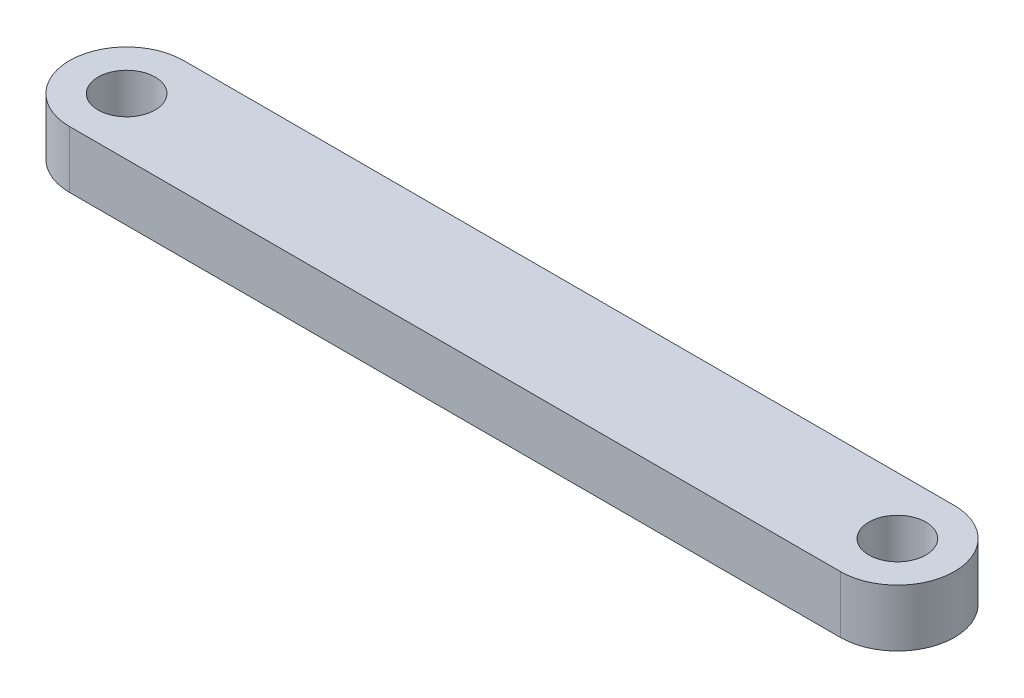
ISO-10303-21;
HEADER;
FILE_DESCRIPTION(('STEP AP214'),'2;1');
FILE_NAME('part.step','',(''),(''),'','','');
FILE_SCHEMA(('AUTOMOTIVE_DESIGN { 1 0 10303 214 1 1 1 1 }'));
ENDSEC;
DATA;
#1=APPLICATION_CONTEXT('core data for automotive mechanical design processes');
#2=APPLICATION_PROTOCOL_DEFINITION('international standard','automotive_design',2000,#1);
#3=PRODUCT_CONTEXT('',#1,'mechanical');
#4=PRODUCT('Part','Part','',(#3));
#5=PRODUCT_RELATED_PRODUCT_CATEGORY('part','',(#4));
#6=PRODUCT_DEFINITION_FORMATION('','',#4);
#7=PRODUCT_DEFINITION_CONTEXT('part definition',#1,'design');
#8=PRODUCT_DEFINITION('design','',#6,#7);
#9=PRODUCT_DEFINITION_SHAPE('','',#8);
#10=(LENGTH_UNIT() NAMED_UNIT(*) SI_UNIT(.MILLI.,.METRE.));
#11=(NAMED_UNIT(*) PLANE_ANGLE_UNIT() SI_UNIT($,.RADIAN.));
#12=(NAMED_UNIT(*) SI_UNIT($,.STERADIAN.) SOLID_ANGLE_UNIT());
#13=UNCERTAINTY_MEASURE_WITH_UNIT(LENGTH_MEASURE(1.E-05),#10,'distance_accuracy_value','');
#14=(GEOMETRIC_REPRESENTATION_CONTEXT(3) GLOBAL_UNCERTAINTY_ASSIGNED_CONTEXT((#13)) GLOBAL_UNIT_ASSIGNED_CONTEXT((#10,
#11,#12)) REPRESENTATION_CONTEXT('',''));
#15=CARTESIAN_POINT('',(0.,0.,0.));
#16=DIRECTION('',(0.,0.,1.));
#17=DIRECTION('',(1.,0.,0.));
#18=AXIS2_PLACEMENT_3D('',#15,#16,#17);
#19=CARTESIAN_POINT('',(-675.,50.,0.));
#20=DIRECTION('',(0.,1.,0.));
#21=DIRECTION('',(0.,0.,1.));
#22=AXIS2_PLACEMENT_3D('',#19,#20,#21);
#23=PLANE('',#22);
#24=CARTESIAN_POINT('',(-675.,50.,0.));
#25=DIRECTION('',(0.,1.,0.));
#26=DIRECTION('',(0.,0.,1.));
#27=AXIS2_PLACEMENT_3D('',#24,#25,#26);
#28=CIRCLE('',#27,50.);
#29=CARTESIAN_POINT('',(-675.,50.,50.));
#30=VERTEX_POINT('',#29);
#31=EDGE_CURVE('E112',#30,#30,#28,.T.);
#32=ORIENTED_EDGE('',*,*,#31,.F.);
#33=EDGE_LOOP('',(#32));
#34=FACE_BOUND('',#33,.T.);
#35=CARTESIAN_POINT('',(-675.,50.,0.));
#36=DIRECTION('',(0.,1.,0.));
#37=DIRECTION('',(0.,0.,1.));
#38=AXIS2_PLACEMENT_3D('',#35,#36,#37);
#39=CIRCLE('',#38,100.);
#40=CARTESIAN_POINT('',(-675.,50.,-100.));
#41=VERTEX_POINT('',#40);
#42=CARTESIAN_POINT('',(-675.,50.,100.));
#43=VERTEX_POINT('',#42);
#44=EDGE_CURVE('E91',#41,#43,#39,.T.);
#45=ORIENTED_EDGE('',*,*,#44,.T.);
#46=DIRECTION('',(1.,0.,0.));
#47=VECTOR('',#46,1.);
#48=CARTESIAN_POINT('',(-675.,50.,100.));
#49=LINE('',#48,#47);
#50=CARTESIAN_POINT('',(675.,50.,99.9999999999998));
#51=VERTEX_POINT('',#50);
#52=EDGE_CURVE('E86',#43,#51,#49,.T.);
#53=ORIENTED_EDGE('',*,*,#52,.T.);
#54=CARTESIAN_POINT('',(675.,50.,-2.47990976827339E-13));
#55=DIRECTION('',(0.,1.,0.));
#56=DIRECTION('',(0.,0.,1.));
#57=AXIS2_PLACEMENT_3D('',#54,#55,#56);
#58=CIRCLE('',#57,100.);
#59=CARTESIAN_POINT('',(675.,50.,-100.));
#60=VERTEX_POINT('',#59);
#61=EDGE_CURVE('E89',#51,#60,#58,.T.);
#62=ORIENTED_EDGE('',*,*,#61,.T.);
#63=DIRECTION('',(-1.,0.,0.));
#64=VECTOR('',#63,1.);
#65=CARTESIAN_POINT('',(-675.,50.,-100.));
#66=LINE('',#65,#64);
#67=EDGE_CURVE('E56',#60,#41,#66,.T.);
#68=ORIENTED_EDGE('',*,*,#67,.T.);
#69=EDGE_LOOP('',(#45,#53,#62,#68));
#70=FACE_BOUND('',#69,.T.);
#71=CARTESIAN_POINT('',(675.,50.,-2.47990976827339E-13));
#72=DIRECTION('',(0.,1.,0.));
#73=DIRECTION('',(0.,0.,1.));
#74=AXIS2_PLACEMENT_3D('',#71,#72,#73);
#75=CIRCLE('',#74,50.);
#76=CARTESIAN_POINT('',(675.,50.,49.9999999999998));
#77=VERTEX_POINT('',#76);
#78=EDGE_CURVE('E133',#77,#77,#75,.T.);
#79=ORIENTED_EDGE('',*,*,#78,.F.);
#80=EDGE_LOOP('',(#79));
#81=FACE_BOUND('',#80,.T.);
#82=ADVANCED_FACE('F38',(#34,#70,#81),#23,.T.);
#83=CARTESIAN_POINT('',(-675.,-50.,0.));
#84=DIRECTION('',(0.,1.,0.));
#85=DIRECTION('',(0.,0.,1.));
#86=AXIS2_PLACEMENT_3D('',#83,#84,#85);
#87=PLANE('',#86);
#88=CARTESIAN_POINT('',(-675.,-50.,0.));
#89=DIRECTION('',(0.,1.,0.));
#90=DIRECTION('',(0.,0.,1.));
#91=AXIS2_PLACEMENT_3D('',#88,#89,#90);
#92=CIRCLE('',#91,100.);
#93=CARTESIAN_POINT('',(-675.,-50.,-100.));
#94=VERTEX_POINT('',#93);
#95=CARTESIAN_POINT('',(-675.,-50.,100.));
#96=VERTEX_POINT('',#95);
#97=EDGE_CURVE('E108',#94,#96,#92,.T.);
#98=ORIENTED_EDGE('',*,*,#97,.F.);
#99=DIRECTION('',(-1.,0.,0.));
#100=VECTOR('',#99,1.);
#101=CARTESIAN_POINT('',(-675.,-50.,-100.));
#102=LINE('',#101,#100);
#103=CARTESIAN_POINT('',(675.,-50.,-100.));
#104=VERTEX_POINT('',#103);
#105=EDGE_CURVE('E79',#104,#94,#102,.T.);
#106=ORIENTED_EDGE('',*,*,#105,.F.);
#107=CARTESIAN_POINT('',(675.,-50.,-2.47990976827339E-13));
#108=DIRECTION('',(0.,1.,0.));
#109=DIRECTION('',(0.,0.,1.));
#110=AXIS2_PLACEMENT_3D('',#107,#108,#109);
#111=CIRCLE('',#110,100.);
#112=CARTESIAN_POINT('',(675.,-50.,99.9999999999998));
#113=VERTEX_POINT('',#112);
#114=EDGE_CURVE('E73',#113,#104,#111,.T.);
#115=ORIENTED_EDGE('',*,*,#114,.F.);
#116=DIRECTION('',(1.,0.,0.));
#117=VECTOR('',#116,1.);
#118=CARTESIAN_POINT('',(-675.,-50.,100.));
#119=LINE('',#118,#117);
#120=EDGE_CURVE('E96',#96,#113,#119,.T.);
#121=ORIENTED_EDGE('',*,*,#120,.F.);
#122=EDGE_LOOP('',(#98,#106,#115,#121));
#123=FACE_BOUND('',#122,.T.);
#124=CARTESIAN_POINT('',(-675.,-50.,0.));
#125=DIRECTION('',(0.,1.,0.));
#126=DIRECTION('',(0.,0.,1.));
#127=AXIS2_PLACEMENT_3D('',#124,#125,#126);
#128=CIRCLE('',#127,50.);
#129=CARTESIAN_POINT('',(-675.,-50.,50.));
#130=VERTEX_POINT('',#129);
#131=EDGE_CURVE('E130',#130,#130,#128,.T.);
#132=ORIENTED_EDGE('',*,*,#131,.T.);
#133=EDGE_LOOP('',(#132));
#134=FACE_BOUND('',#133,.T.);
#135=CARTESIAN_POINT('',(675.,-50.,-2.47990976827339E-13));
#136=DIRECTION('',(0.,1.,0.));
#137=DIRECTION('',(0.,0.,1.));
#138=AXIS2_PLACEMENT_3D('',#135,#136,#137);
#139=CIRCLE('',#138,50.);
#140=CARTESIAN_POINT('',(675.,-50.,49.9999999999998));
#141=VERTEX_POINT('',#140);
#142=EDGE_CURVE('E137',#141,#141,#139,.T.);
#143=ORIENTED_EDGE('',*,*,#142,.T.);
#144=EDGE_LOOP('',(#143));
#145=FACE_BOUND('',#144,.T.);
#146=ADVANCED_FACE('F124',(#123,#134,#145),#87,.F.);
#147=CARTESIAN_POINT('',(-675.,50.,0.));
#148=DIRECTION('',(0.,-1.,0.));
#149=DIRECTION('',(0.,0.,-1.));
#150=AXIS2_PLACEMENT_3D('',#147,#148,#149);
#151=CYLINDRICAL_SURFACE('',#150,100.);
#152=ORIENTED_EDGE('',*,*,#97,.T.);
#153=DIRECTION('',(0.,-1.,0.));
#154=VECTOR('',#153,1.);
#155=CARTESIAN_POINT('',(-675.,50.,100.));
#156=LINE('',#155,#154);
#157=EDGE_CURVE('E11',#43,#96,#156,.T.);
#158=ORIENTED_EDGE('',*,*,#157,.F.);
#159=ORIENTED_EDGE('',*,*,#44,.F.);
#160=DIRECTION('',(0.,-1.,0.));
#161=VECTOR('',#160,1.);
#162=CARTESIAN_POINT('',(-675.,50.,-100.));
#163=LINE('',#162,#161);
#164=EDGE_CURVE('E104',#41,#94,#163,.T.);
#165=ORIENTED_EDGE('',*,*,#164,.T.);
#166=EDGE_LOOP('',(#152,#158,#159,#165));
#167=FACE_BOUND('',#166,.T.);
#168=ADVANCED_FACE('F40',(#167),#151,.T.);
#169=CARTESIAN_POINT('',(-675.,50.,100.));
#170=DIRECTION('',(0.,0.,-1.));
#171=DIRECTION('',(-1.,0.,0.));
#172=AXIS2_PLACEMENT_3D('',#169,#170,#171);
#173=PLANE('',#172);
#174=ORIENTED_EDGE('',*,*,#120,.T.);
#175=DIRECTION('',(0.,-1.,0.));
#176=VECTOR('',#175,1.);
#177=CARTESIAN_POINT('',(675.,50.,99.9999999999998));
#178=LINE('',#177,#176);
#179=EDGE_CURVE('E48',#51,#113,#178,.T.);
#180=ORIENTED_EDGE('',*,*,#179,.F.);
#181=ORIENTED_EDGE('',*,*,#52,.F.);
#182=ORIENTED_EDGE('',*,*,#157,.T.);
#183=EDGE_LOOP('',(#174,#180,#181,#182));
#184=FACE_BOUND('',#183,.T.);
#185=ADVANCED_FACE('F95',(#184),#173,.F.);
#186=CARTESIAN_POINT('',(675.,50.,-2.47990976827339E-13));
#187=DIRECTION('',(0.,-1.,0.));
#188=DIRECTION('',(0.,0.,-1.));
#189=AXIS2_PLACEMENT_3D('',#186,#187,#188);
#190=CYLINDRICAL_SURFACE('',#189,100.);
#191=ORIENTED_EDGE('',*,*,#114,.T.);
#192=DIRECTION('',(0.,-1.,0.));
#193=VECTOR('',#192,1.);
#194=CARTESIAN_POINT('',(675.,50.,-100.));
#195=LINE('',#194,#193);
#196=EDGE_CURVE('E98',#60,#104,#195,.T.);
#197=ORIENTED_EDGE('',*,*,#196,.F.);
#198=ORIENTED_EDGE('',*,*,#61,.F.);
#199=ORIENTED_EDGE('',*,*,#179,.T.);
#200=EDGE_LOOP('',(#191,#197,#198,#199));
#201=FACE_BOUND('',#200,.T.);
#202=ADVANCED_FACE('F99',(#201),#190,.T.);
#203=CARTESIAN_POINT('',(-675.,50.,-100.));
#204=DIRECTION('',(0.,0.,1.));
#205=DIRECTION('',(1.,0.,0.));
#206=AXIS2_PLACEMENT_3D('',#203,#204,#205);
#207=PLANE('',#206);
#208=ORIENTED_EDGE('',*,*,#105,.T.);
#209=ORIENTED_EDGE('',*,*,#164,.F.);
#210=ORIENTED_EDGE('',*,*,#67,.F.);
#211=ORIENTED_EDGE('',*,*,#196,.T.);
#212=EDGE_LOOP('',(#208,#209,#210,#211));
#213=FACE_BOUND('',#212,.T.);
#214=ADVANCED_FACE('F121',(#213),#207,.F.);
#215=CARTESIAN_POINT('',(-675.,50.,0.));
#216=DIRECTION('',(0.,-1.,0.));
#217=DIRECTION('',(0.,0.,-1.));
#218=AXIS2_PLACEMENT_3D('',#215,#216,#217);
#219=CYLINDRICAL_SURFACE('',#218,50.);
#220=ORIENTED_EDGE('',*,*,#31,.T.);
#221=EDGE_LOOP('',(#220));
#222=FACE_BOUND('',#221,.T.);
#223=ORIENTED_EDGE('',*,*,#131,.F.);
#224=EDGE_LOOP('',(#223));
#225=FACE_BOUND('',#224,.T.);
#226=ADVANCED_FACE('F156',(#222,#225),#219,.F.);
#227=CARTESIAN_POINT('',(675.,50.,-2.47990976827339E-13));
#228=DIRECTION('',(0.,-1.,0.));
#229=DIRECTION('',(0.,0.,-1.));
#230=AXIS2_PLACEMENT_3D('',#227,#228,#229);
#231=CYLINDRICAL_SURFACE('',#230,50.);
#232=ORIENTED_EDGE('',*,*,#78,.T.);
#233=EDGE_LOOP('',(#232));
#234=FACE_BOUND('',#233,.T.);
#235=ORIENTED_EDGE('',*,*,#142,.F.);
#236=EDGE_LOOP('',(#235));
#237=FACE_BOUND('',#236,.T.);
#238=ADVANCED_FACE('F145',(#234,#237),#231,.F.);
#239=CLOSED_SHELL('',(#82,#146,#168,#185,#202,#214,#226,#238));
#240=MANIFOLD_SOLID_BREP('B2',#239);
#241=ADVANCED_BREP_SHAPE_REPRESENTATION('',(#18,#240),#14);
#242=SHAPE_DEFINITION_REPRESENTATION(#9,#241);
ENDSEC;
END-ISO-10303-21;
